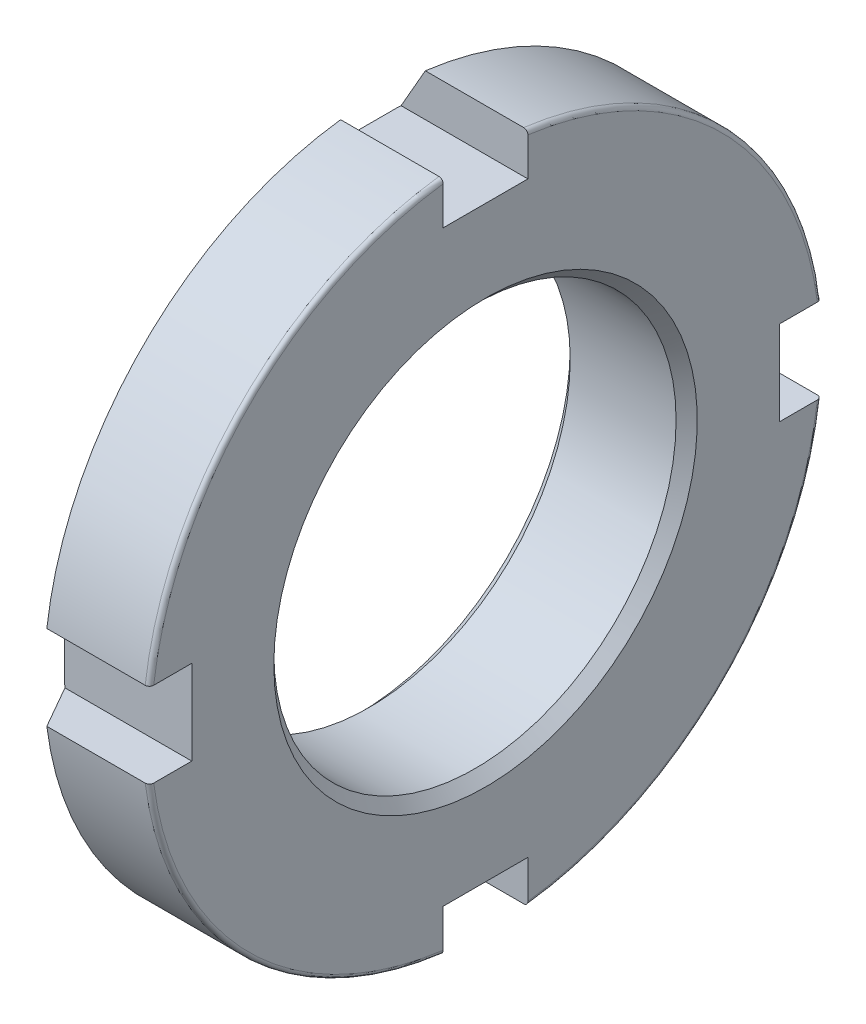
from build123d import *

# Parameters (mm, degrees)
CHANFREIN1_SIZE              = 0.5
ESQUISSE2_W                  = 4
ESQUISSE2_H                  = 2.125492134
ENL_V_MAT_EXTRU_1_DEPTH      = 24.40939989
R_P_TITION_CIRCULAIRE1_COUNT = 4


with BuildPart() as part:
    # Esquisse1 → Base-R_volution (revolve)
    with BuildSketch(Plane.XY, mode=Mode.PRIVATE) as base_r_volution_sk:
        with BuildLine():
            Line((1.154700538, 16), (0, 14))
            Line((0, 14), (0, 9.5))
            Line((0, 9.5), (6, 9.5))
            Line((6, 9.5), (6, 15.8))
            ThreePointArc((6, 15.8), (5.941421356, 15.941421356), (5.8, 16))
            Line((5.8, 16), (1.154700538, 16))
        make_face()
    revolve(base_r_volution_sk.sketch.rotate(Axis((0, 0, 0), (1, 0, 0)), 90), axis=Axis((0, 0, 0), (1, 0, 0)))

    # Chanfrein1
    chanfrein1_edges = [part.edges().sort_by_distance(p)[0] for p in [
        (0, 0, -9.5),
        (6, 0, -9.5),
    ]]
    chamfer(chanfrein1_edges, length=CHANFREIN1_SIZE)

    # Esquisse2 → Enl_v. mat.-Extru.1 (cut, through all)
    with BuildSketch(Plane(origin=(6, 0, 0), x_dir=(0, 0, -1), z_dir=(1, 0, 0))):
        with Locations((0, 14.937253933)):
            Rectangle(ESQUISSE2_W, ESQUISSE2_H)
    enl_v_mat_extru_1 = extrude(amount=-ENL_V_MAT_EXTRU_1_DEPTH, mode=Mode.SUBTRACT)

    # R_p_tition circulaire1: Enl_v. mat.-Extru.1 ×4 about axis
    r_p_tition_circulaire1_axis = Axis((0, 0, 0), (1, 0, 0))
    for i in range(1, R_P_TITION_CIRCULAIRE1_COUNT):
        add(enl_v_mat_extru_1.rotate(r_p_tition_circulaire1_axis, i * 360 / R_P_TITION_CIRCULAIRE1_COUNT), mode=Mode.SUBTRACT)


solid = part.part
